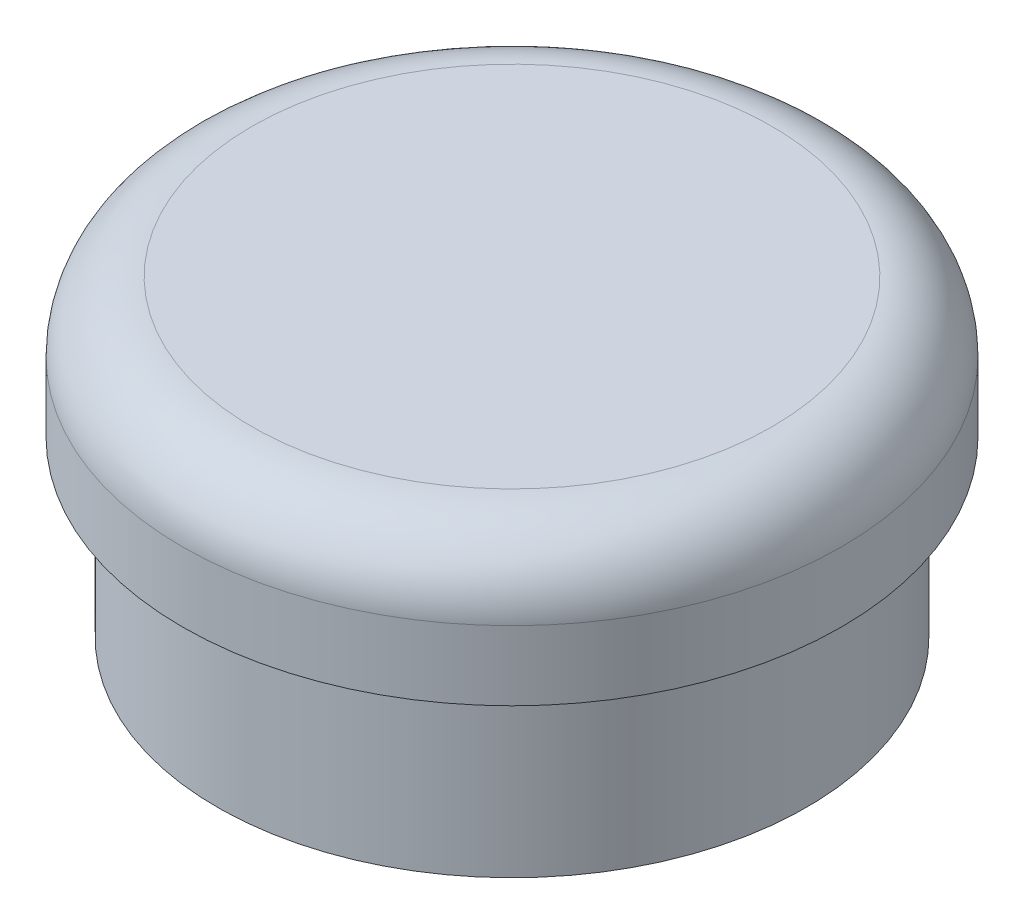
from build123d import *


with BuildPart() as part:
    # Esquisse1 → R_volution1 (revolve)
    with BuildSketch(Plane(origin=(0, 0, 0), x_dir=(-1, 0, 0), z_dir=(0, 0, -1)), mode=Mode.PRIVATE) as r_volution1_sk:
        with BuildLine():
            Line((-6.5, 7), (0, 7))
            Line((0, 7), (0, 9))
            Line((0, 9), (-7.5, 9))
            ThreePointArc((-7.5, 9), (-8.914213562, 8.414213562), (-9.5, 7))
            Line((-9.5, 7), (-9.5, 5))
            Line((-9.5, 5), (-8.5, 5))
            Line((-8.5, 5), (-8.5, 0))
            Line((-8.5, 0), (-6.5, 0))
            Line((-6.5, 0), (-6.5, 7))
        make_face()
    revolve(r_volution1_sk.sketch.rotate(Axis((0, 0, 0), (0, 1, 0)), 180), axis=Axis((0, 0, 0), (0, 1, 0)))


solid = part.part
